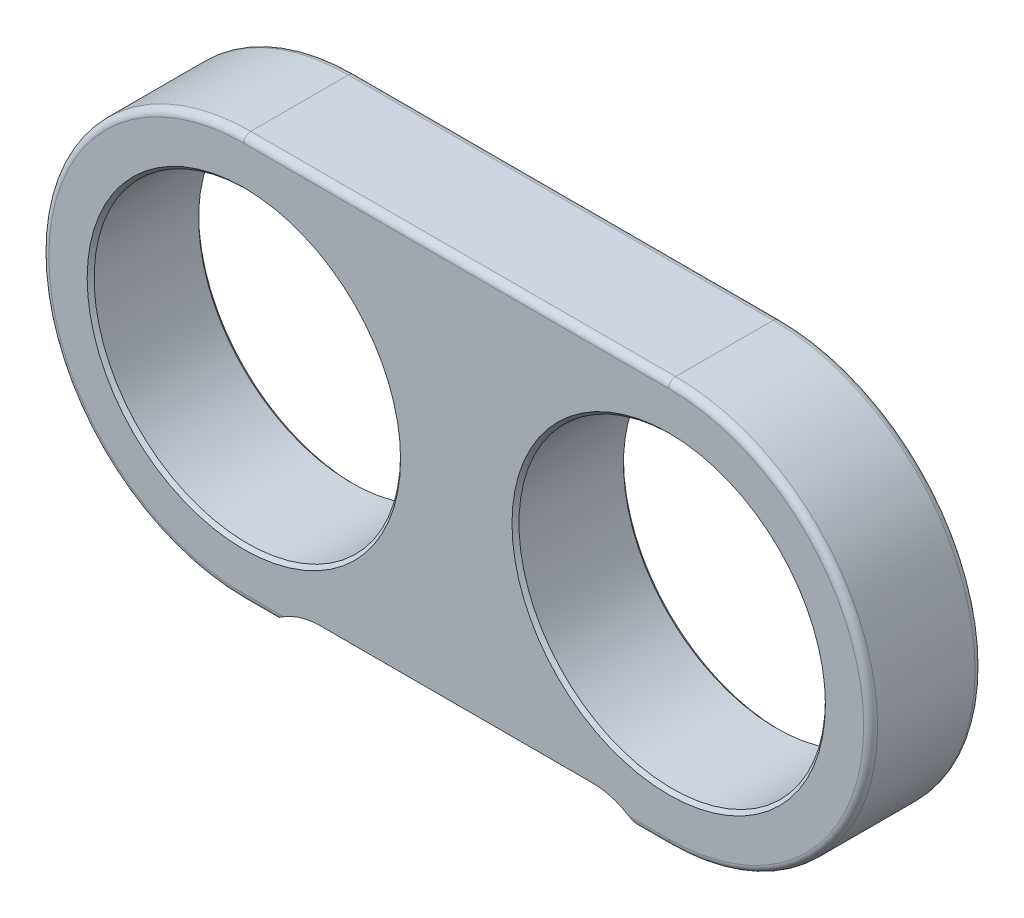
from build123d import *

# Parameters (mm, degrees)
ESQUISSE1_R          = 22
BASE_EXTRUSION_DEPTH = 16
CONG_1_R             = 1
CHANFREIN1_SIZE      = 0.5


with BuildPart() as part:
    # Esquisse1 → Base-Extrusion (new body)
    with BuildSketch(Plane.XY):
        with BuildLine():
            Line((0, 29), (61, 29))
            ThreePointArc((61, 29), (90, 0), (61, -29))
            Line((61, -29), (56.614378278, -29))
            ThreePointArc((56.614378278, -29), (53.535533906, -27.145856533), (50, -26.5))
            Line((50, -26.5), (11, -26.5))
            ThreePointArc((11, -26.5), (7.464466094, -27.145856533), (4.385621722, -29))
            Line((4.385621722, -29), (0, -29))
            ThreePointArc((0, -29), (-29, 0), (0, 29))
        make_face()
        Circle(ESQUISSE1_R, mode=Mode.SUBTRACT)
        with Locations((61, 0)):
            Circle(ESQUISSE1_R, mode=Mode.SUBTRACT)
    extrude(amount=BASE_EXTRUSION_DEPTH)

    # Cong_1
    cong_1_edges = [part.edges().sort_by_distance(p)[0] for p in [
        (30.5, 29, 0),
        (30.5, 29, 16),
        (90, 0, 0),
        (90, 0, 16),
        (58.807189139, -29, 0),
        (58.807189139, -29, 16),
        (2.192810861, -29, 0),
        (2.192810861, -29, 16),
        (-29, 0, 0),
        (-29, 0, 16),
    ]]
    fillet(cong_1_edges, radius=CONG_1_R)

    # Chanfrein1
    chanfrein1_edges = [part.edges().sort_by_distance(p)[0] for p in [
        (-22, 0, 0),
        (39, 0, 0),
        (-22, 0, 16),
        (39, 0, 16),
    ]]
    chamfer(chanfrein1_edges, length=CHANFREIN1_SIZE)


solid = part.part
